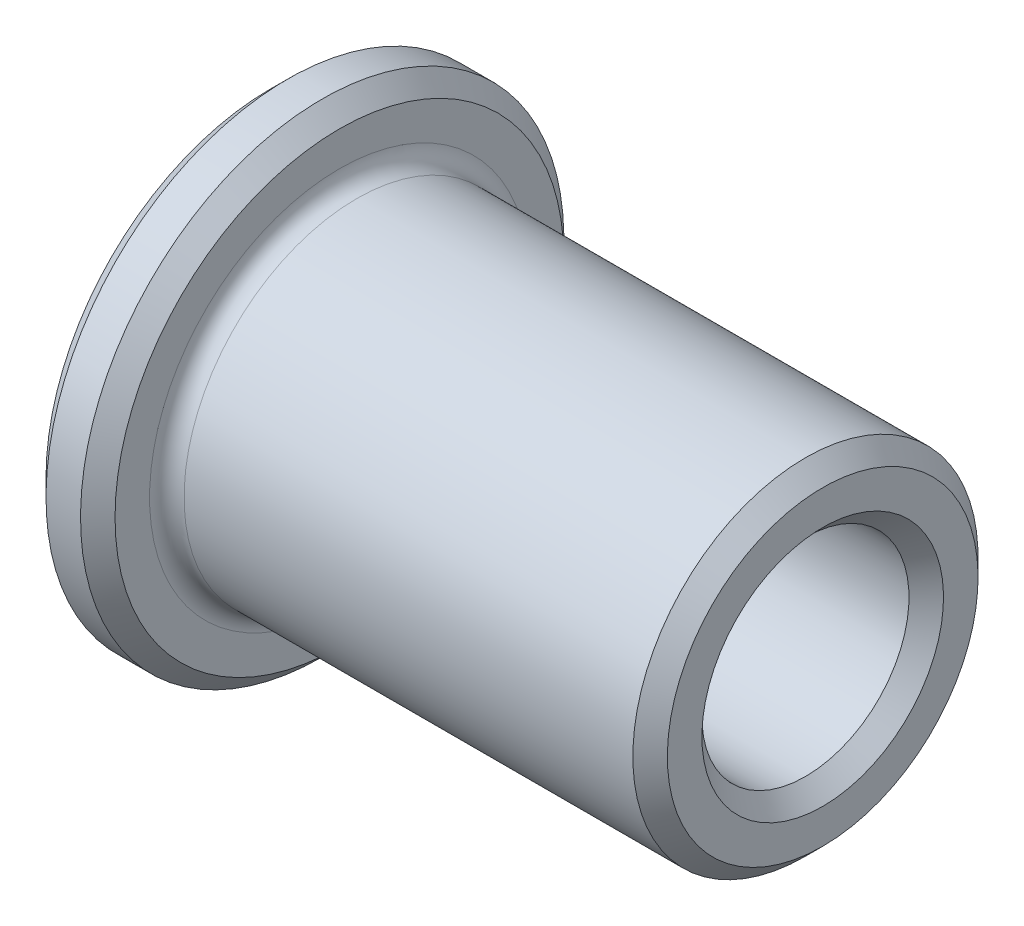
ISO-10303-21;
HEADER;
FILE_DESCRIPTION(('STEP AP214'),'2;1');
FILE_NAME('part.step','',(''),(''),'','','');
FILE_SCHEMA(('AUTOMOTIVE_DESIGN { 1 0 10303 214 1 1 1 1 }'));
ENDSEC;
DATA;
#1=APPLICATION_CONTEXT('core data for automotive mechanical design processes');
#2=APPLICATION_PROTOCOL_DEFINITION('international standard','automotive_design',2000,#1);
#3=PRODUCT_CONTEXT('',#1,'mechanical');
#4=PRODUCT('Part','Part','',(#3));
#5=PRODUCT_RELATED_PRODUCT_CATEGORY('part','',(#4));
#6=PRODUCT_DEFINITION_FORMATION('','',#4);
#7=PRODUCT_DEFINITION_CONTEXT('part definition',#1,'design');
#8=PRODUCT_DEFINITION('design','',#6,#7);
#9=PRODUCT_DEFINITION_SHAPE('','',#8);
#10=(LENGTH_UNIT() NAMED_UNIT(*) SI_UNIT(.MILLI.,.METRE.));
#11=(NAMED_UNIT(*) PLANE_ANGLE_UNIT() SI_UNIT($,.RADIAN.));
#12=(NAMED_UNIT(*) SI_UNIT($,.STERADIAN.) SOLID_ANGLE_UNIT());
#13=UNCERTAINTY_MEASURE_WITH_UNIT(LENGTH_MEASURE(1.E-05),#10,'distance_accuracy_value','');
#14=(GEOMETRIC_REPRESENTATION_CONTEXT(3) GLOBAL_UNCERTAINTY_ASSIGNED_CONTEXT((#13)) GLOBAL_UNIT_ASSIGNED_CONTEXT((#10,
#11,#12)) REPRESENTATION_CONTEXT('',''));
#15=CARTESIAN_POINT('',(0.,0.,0.));
#16=DIRECTION('',(0.,0.,1.));
#17=DIRECTION('',(1.,0.,0.));
#18=AXIS2_PLACEMENT_3D('',#15,#16,#17);
#19=CARTESIAN_POINT('',(-2.,-5.,0.));
#20=DIRECTION('',(-1.,0.,0.));
#21=DIRECTION('',(0.,-1.,0.));
#22=AXIS2_PLACEMENT_3D('',#19,#20,#21);
#23=PLANE('',#22);
#24=CARTESIAN_POINT('',(-2.,0.,0.));
#25=DIRECTION('',(1.,0.,0.));
#26=DIRECTION('',(0.,-1.,0.));
#27=AXIS2_PLACEMENT_3D('',#24,#25,#26);
#28=CIRCLE('',#27,3.5);
#29=CARTESIAN_POINT('',(-2.,-3.5,0.));
#30=VERTEX_POINT('',#29);
#31=EDGE_CURVE('E8',#30,#30,#28,.T.);
#32=ORIENTED_EDGE('',*,*,#31,.T.);
#33=EDGE_LOOP('',(#32));
#34=FACE_BOUND('',#33,.T.);
#35=CARTESIAN_POINT('',(-2.,0.,0.));
#36=DIRECTION('',(1.,0.,0.));
#37=DIRECTION('',(0.,-1.,0.));
#38=AXIS2_PLACEMENT_3D('',#35,#36,#37);
#39=CIRCLE('',#38,6.5);
#40=CARTESIAN_POINT('',(-2.,-6.5,0.));
#41=VERTEX_POINT('',#40);
#42=EDGE_CURVE('E127',#41,#41,#39,.T.);
#43=ORIENTED_EDGE('',*,*,#42,.F.);
#44=EDGE_LOOP('',(#43));
#45=FACE_BOUND('',#44,.T.);
#46=ADVANCED_FACE('F13',(#34,#45),#23,.T.);
#47=CARTESIAN_POINT('',(14.,-4.,0.));
#48=DIRECTION('',(1.,0.,0.));
#49=DIRECTION('',(0.,1.,0.));
#50=AXIS2_PLACEMENT_3D('',#47,#48,#49);
#51=PLANE('',#50);
#52=CARTESIAN_POINT('',(14.,0.,0.));
#53=DIRECTION('',(1.,0.,0.));
#54=DIRECTION('',(0.,-1.,0.));
#55=AXIS2_PLACEMENT_3D('',#52,#53,#54);
#56=CIRCLE('',#55,3.5);
#57=CARTESIAN_POINT('',(14.,-3.5,0.));
#58=VERTEX_POINT('',#57);
#59=EDGE_CURVE('E115',#58,#58,#56,.T.);
#60=ORIENTED_EDGE('',*,*,#59,.F.);
#61=EDGE_LOOP('',(#60));
#62=FACE_BOUND('',#61,.T.);
#63=CARTESIAN_POINT('',(14.,0.,0.));
#64=DIRECTION('',(1.,0.,0.));
#65=DIRECTION('',(0.,-1.,0.));
#66=AXIS2_PLACEMENT_3D('',#63,#64,#65);
#67=CIRCLE('',#66,4.5);
#68=CARTESIAN_POINT('',(14.,-4.5,0.));
#69=VERTEX_POINT('',#68);
#70=EDGE_CURVE('E22',#69,#69,#67,.T.);
#71=ORIENTED_EDGE('',*,*,#70,.T.);
#72=EDGE_LOOP('',(#71));
#73=FACE_BOUND('',#72,.T.);
#74=ADVANCED_FACE('F85',(#62,#73),#51,.T.);
#75=CARTESIAN_POINT('',(0.,-6.,0.));
#76=DIRECTION('',(1.,0.,0.));
#77=DIRECTION('',(0.,1.,0.));
#78=AXIS2_PLACEMENT_3D('',#75,#76,#77);
#79=PLANE('',#78);
#80=CARTESIAN_POINT('',(0.,0.,0.));
#81=DIRECTION('',(1.,0.,0.));
#82=DIRECTION('',(0.,-1.,0.));
#83=AXIS2_PLACEMENT_3D('',#80,#81,#82);
#84=CIRCLE('',#83,5.5);
#85=CARTESIAN_POINT('',(0.,-5.5,0.));
#86=VERTEX_POINT('',#85);
#87=EDGE_CURVE('E103',#86,#86,#84,.T.);
#88=ORIENTED_EDGE('',*,*,#87,.F.);
#89=EDGE_LOOP('',(#88));
#90=FACE_BOUND('',#89,.T.);
#91=CARTESIAN_POINT('',(0.,0.,0.));
#92=DIRECTION('',(1.,0.,0.));
#93=DIRECTION('',(0.,-1.,0.));
#94=AXIS2_PLACEMENT_3D('',#91,#92,#93);
#95=CIRCLE('',#94,6.5);
#96=CARTESIAN_POINT('',(0.,-6.5,0.));
#97=VERTEX_POINT('',#96);
#98=EDGE_CURVE('E32',#97,#97,#95,.T.);
#99=ORIENTED_EDGE('',*,*,#98,.T.);
#100=EDGE_LOOP('',(#99));
#101=FACE_BOUND('',#100,.T.);
#102=ADVANCED_FACE('F90',(#90,#101),#79,.T.);
#103=CARTESIAN_POINT('',(-1.,0.,0.));
#104=DIRECTION('',(1.,0.,0.));
#105=DIRECTION('',(0.,1.,0.));
#106=AXIS2_PLACEMENT_3D('',#103,#104,#105);
#107=CYLINDRICAL_SURFACE('',#106,7.);
#108=CARTESIAN_POINT('',(-0.5,0.,0.));
#109=DIRECTION('',(1.,0.,0.));
#110=DIRECTION('',(0.,-1.,0.));
#111=AXIS2_PLACEMENT_3D('',#108,#109,#110);
#112=CIRCLE('',#111,7.);
#113=CARTESIAN_POINT('',(-0.500000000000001,-7.,0.));
#114=VERTEX_POINT('',#113);
#115=EDGE_CURVE('E121',#114,#114,#112,.T.);
#116=ORIENTED_EDGE('',*,*,#115,.F.);
#117=EDGE_LOOP('',(#116));
#118=FACE_BOUND('',#117,.T.);
#119=CARTESIAN_POINT('',(-1.5,0.,0.));
#120=DIRECTION('',(1.,0.,0.));
#121=DIRECTION('',(0.,-1.,0.));
#122=AXIS2_PLACEMENT_3D('',#119,#120,#121);
#123=CIRCLE('',#122,7.);
#124=CARTESIAN_POINT('',(-1.5,-7.,0.));
#125=VERTEX_POINT('',#124);
#126=EDGE_CURVE('E122',#125,#125,#123,.T.);
#127=ORIENTED_EDGE('',*,*,#126,.T.);
#128=EDGE_LOOP('',(#127));
#129=FACE_BOUND('',#128,.T.);
#130=ADVANCED_FACE('F53',(#118,#129),#107,.T.);
#131=DIRECTION('',(0.707106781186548,0.707106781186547,0.));
#132=VECTOR('',#131,1.);
#133=CARTESIAN_POINT('',(-498993.500000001,-499000.,-1.22215714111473E-10));
#134=LINE('',#133,#132);
#135=CARTESIAN_POINT('',(6.50000000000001,0.,0.));
#136=DIRECTION('',(-1.,0.,0.));
#137=AXIS1_PLACEMENT('',#135,#136);
#138=SURFACE_OF_REVOLUTION('',#134,#137);
#139=ORIENTED_EDGE('',*,*,#98,.F.);
#140=EDGE_LOOP('',(#139));
#141=FACE_BOUND('',#140,.T.);
#142=ORIENTED_EDGE('',*,*,#115,.T.);
#143=EDGE_LOOP('',(#142));
#144=FACE_BOUND('',#143,.T.);
#145=ADVANCED_FACE('F48',(#141,#144),#138,.F.);
#146=CARTESIAN_POINT('',(0.5,0.,0.));
#147=DIRECTION('',(1.,0.,0.));
#148=DIRECTION('',(0.,0.,-1.));
#149=AXIS2_PLACEMENT_3D('',#146,#147,#148);
#150=TOROIDAL_SURFACE('',#149,5.5,0.5);
#151=ORIENTED_EDGE('',*,*,#87,.T.);
#152=EDGE_LOOP('',(#151));
#153=FACE_BOUND('',#152,.T.);
#154=CARTESIAN_POINT('',(0.5,0.,0.));
#155=DIRECTION('',(1.,0.,0.));
#156=DIRECTION('',(0.,-1.,0.));
#157=AXIS2_PLACEMENT_3D('',#154,#155,#156);
#158=CIRCLE('',#157,5.);
#159=CARTESIAN_POINT('',(0.499999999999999,-5.,0.));
#160=VERTEX_POINT('',#159);
#161=EDGE_CURVE('E41',#160,#160,#158,.T.);
#162=ORIENTED_EDGE('',*,*,#161,.F.);
#163=EDGE_LOOP('',(#162));
#164=FACE_BOUND('',#163,.T.);
#165=ADVANCED_FACE('F52',(#153,#164),#150,.F.);
#166=CARTESIAN_POINT('',(7.,0.,0.));
#167=DIRECTION('',(1.,0.,0.));
#168=DIRECTION('',(0.,1.,0.));
#169=AXIS2_PLACEMENT_3D('',#166,#167,#168);
#170=CYLINDRICAL_SURFACE('',#169,5.);
#171=CARTESIAN_POINT('',(13.5,0.,0.));
#172=DIRECTION('',(1.,0.,0.));
#173=DIRECTION('',(0.,-1.,0.));
#174=AXIS2_PLACEMENT_3D('',#171,#172,#173);
#175=CIRCLE('',#174,5.);
#176=CARTESIAN_POINT('',(13.5,-5.,0.));
#177=VERTEX_POINT('',#176);
#178=EDGE_CURVE('E111',#177,#177,#175,.T.);
#179=ORIENTED_EDGE('',*,*,#178,.F.);
#180=EDGE_LOOP('',(#179));
#181=FACE_BOUND('',#180,.T.);
#182=ORIENTED_EDGE('',*,*,#161,.T.);
#183=EDGE_LOOP('',(#182));
#184=FACE_BOUND('',#183,.T.);
#185=ADVANCED_FACE('F58',(#181,#184),#170,.T.);
#186=DIRECTION('',(0.707106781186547,0.707106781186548,0.));
#187=VECTOR('',#186,1.);
#188=CARTESIAN_POINT('',(-498981.5,-499000.,-1.22215714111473E-10));
#189=LINE('',#188,#187);
#190=CARTESIAN_POINT('',(18.5,0.,0.));
#191=DIRECTION('',(-1.,0.,0.));
#192=AXIS1_PLACEMENT('',#190,#191);
#193=SURFACE_OF_REVOLUTION('',#189,#192);
#194=ORIENTED_EDGE('',*,*,#70,.F.);
#195=EDGE_LOOP('',(#194));
#196=FACE_BOUND('',#195,.T.);
#197=ORIENTED_EDGE('',*,*,#178,.T.);
#198=EDGE_LOOP('',(#197));
#199=FACE_BOUND('',#198,.T.);
#200=ADVANCED_FACE('F62',(#196,#199),#193,.F.);
#201=DIRECTION('',(0.707106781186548,-0.707106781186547,0.));
#202=VECTOR('',#201,1.);
#203=CARTESIAN_POINT('',(499000.,-498989.5,-1.2221314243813E-10));
#204=LINE('',#203,#202);
#205=CARTESIAN_POINT('',(10.5,0.,0.));
#206=DIRECTION('',(1.,0.,0.));
#207=AXIS1_PLACEMENT('',#205,#206);
#208=SURFACE_OF_REVOLUTION('',#204,#207);
#209=ORIENTED_EDGE('',*,*,#59,.T.);
#210=EDGE_LOOP('',(#209));
#211=FACE_BOUND('',#210,.T.);
#212=CARTESIAN_POINT('',(13.5,0.,0.));
#213=DIRECTION('',(1.,0.,0.));
#214=DIRECTION('',(0.,-1.,0.));
#215=AXIS2_PLACEMENT_3D('',#212,#213,#214);
#216=CIRCLE('',#215,3.);
#217=CARTESIAN_POINT('',(13.5,-3.,0.));
#218=VERTEX_POINT('',#217);
#219=EDGE_CURVE('E38',#218,#218,#216,.T.);
#220=ORIENTED_EDGE('',*,*,#219,.F.);
#221=EDGE_LOOP('',(#220));
#222=FACE_BOUND('',#221,.T.);
#223=ADVANCED_FACE('F66',(#211,#222),#208,.F.);
#224=CARTESIAN_POINT('',(6.,0.,0.));
#225=DIRECTION('',(1.,0.,0.));
#226=DIRECTION('',(0.,1.,0.));
#227=AXIS2_PLACEMENT_3D('',#224,#225,#226);
#228=CYLINDRICAL_SURFACE('',#227,3.);
#229=CARTESIAN_POINT('',(-1.5,0.,0.));
#230=DIRECTION('',(1.,0.,0.));
#231=DIRECTION('',(0.,-1.,0.));
#232=AXIS2_PLACEMENT_3D('',#229,#230,#231);
#233=CIRCLE('',#232,3.);
#234=CARTESIAN_POINT('',(-1.5,-3.,0.));
#235=VERTEX_POINT('',#234);
#236=EDGE_CURVE('E36',#235,#235,#233,.T.);
#237=ORIENTED_EDGE('',*,*,#236,.F.);
#238=EDGE_LOOP('',(#237));
#239=FACE_BOUND('',#238,.T.);
#240=ORIENTED_EDGE('',*,*,#219,.T.);
#241=EDGE_LOOP('',(#240));
#242=FACE_BOUND('',#241,.T.);
#243=ADVANCED_FACE('F15',(#239,#242),#228,.F.);
#244=DIRECTION('',(-0.707106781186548,-0.707106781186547,0.));
#245=VECTOR('',#244,1.);
#246=CARTESIAN_POINT('',(-498998.5,-499000.,-1.22215714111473E-10));
#247=LINE('',#246,#245);
#248=CARTESIAN_POINT('',(1.5,0.,0.));
#249=DIRECTION('',(-1.,0.,0.));
#250=AXIS1_PLACEMENT('',#248,#249);
#251=SURFACE_OF_REVOLUTION('',#247,#250);
#252=ORIENTED_EDGE('',*,*,#31,.F.);
#253=EDGE_LOOP('',(#252));
#254=FACE_BOUND('',#253,.T.);
#255=ORIENTED_EDGE('',*,*,#236,.T.);
#256=EDGE_LOOP('',(#255));
#257=FACE_BOUND('',#256,.T.);
#258=ADVANCED_FACE('F73',(#254,#257),#251,.F.);
#259=DIRECTION('',(-0.707106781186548,0.707106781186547,0.));
#260=VECTOR('',#259,1.);
#261=CARTESIAN_POINT('',(498991.5,-499000.,-1.22215714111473E-10));
#262=LINE('',#261,#260);
#263=CARTESIAN_POINT('',(-8.50000000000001,0.,0.));
#264=DIRECTION('',(1.,0.,0.));
#265=AXIS1_PLACEMENT('',#263,#264);
#266=SURFACE_OF_REVOLUTION('',#262,#265);
#267=ORIENTED_EDGE('',*,*,#42,.T.);
#268=EDGE_LOOP('',(#267));
#269=FACE_BOUND('',#268,.T.);
#270=ORIENTED_EDGE('',*,*,#126,.F.);
#271=EDGE_LOOP('',(#270));
#272=FACE_BOUND('',#271,.T.);
#273=ADVANCED_FACE('F75',(#269,#272),#266,.F.);
#274=CLOSED_SHELL('',(#46,#74,#102,#130,#145,#165,#185,#200,#223,#243,#258,#273));
#275=MANIFOLD_SOLID_BREP('B1',#274);
#276=ADVANCED_BREP_SHAPE_REPRESENTATION('',(#18,#275),#14);
#277=SHAPE_DEFINITION_REPRESENTATION(#9,#276);
ENDSEC;
END-ISO-10303-21;
